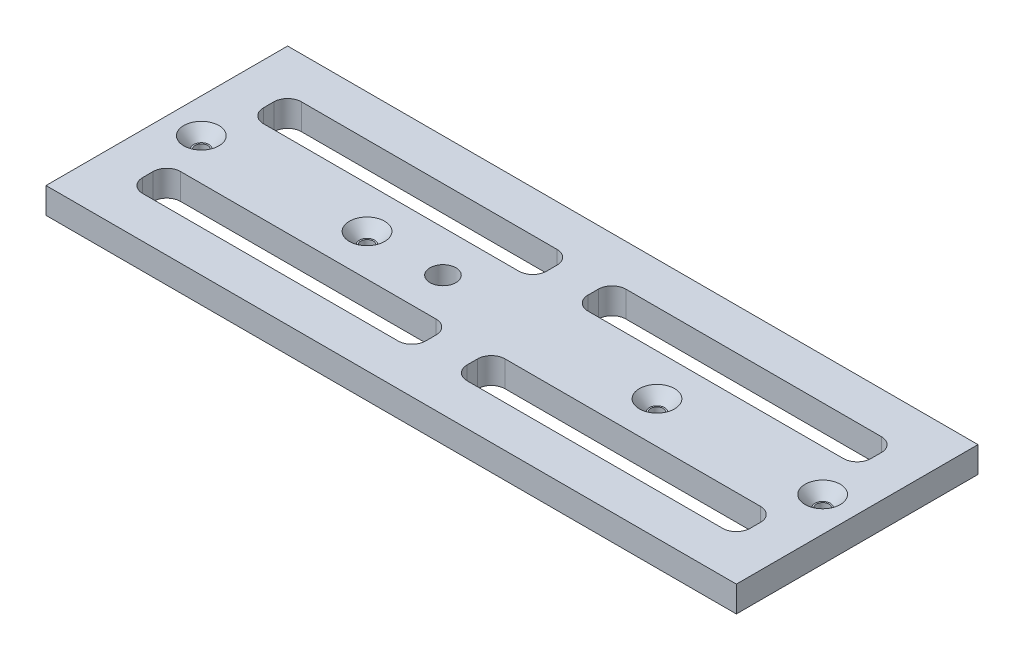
from build123d import *

# Parameters (mm, degrees)
SKETCH1_W                    = 127
SKETCH1_H                    = 44.45
BOSS_EXTRUDE1_DEPTH          = 4.7625
SKETCH3_R                    = 1.143
CUT_EXTRUDE2_DEPTH           = 68.445400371
SKETCH4_R                    = 3.2385
CUT_EXTRUDE3_DEPTH           = 2.1082
CUT_EXTRUDE3_DRAFT           = -41
CUT_EXTRUDE3_PROFILE_2_DEPTH = 2.1082
CUT_EXTRUDE3_PROFILE_2_DRAFT = -41
CUT_EXTRUDE3_PROFILE_3_DEPTH = 2.1082
CUT_EXTRUDE3_PROFILE_3_DRAFT = -41
CUT_EXTRUDE3_PROFILE_4_DEPTH = 2.1082
CUT_EXTRUDE3_PROFILE_4_DRAFT = -41
SKETCH5_R                    = 2.38125
CUT_EXTRUDE4_DEPTH           = 68.445400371
SKETCH6_W                    = 52.07
SKETCH6_H                    = 6.985
CUT_EXTRUDE5_DEPTH           = 68.445400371
FILLET1_R                    = 2.54


with BuildPart() as part:
    # Sketch1 → Boss-Extrude1 (new body)
    with BuildSketch(Plane(origin=(0, 0, 0), x_dir=(1, 0, 0), z_dir=(0, 1, 0))):
        Rectangle(SKETCH1_W, SKETCH1_H)
    extrude(amount=BOSS_EXTRUDE1_DEPTH)

    # Sketch3 → Cut-Extrude2 (cut, through all)
    with BuildSketch(Plane(origin=(0, 4.7625, 0), x_dir=(1, 0, 0), z_dir=(0, 1, 0))):
        with Locations(Location((-57.15, 0, 0), (0, 0, 270))):
            Circle(SKETCH3_R)
        with Locations(Location((-26.67, 0, 0), (0, 0, 270))):
            Circle(SKETCH3_R)
        with Locations(Location((26.67, 0, 0), (0, 0, 270))):
            Circle(SKETCH3_R)
        with Locations(Location((57.15, 0, 0), (0, 0, 270))):
            Circle(SKETCH3_R)
    extrude(amount=-CUT_EXTRUDE2_DEPTH, mode=Mode.SUBTRACT)


with BuildPart() as cut_extrude3_tool:
    # Sketch4 → Cut-Extrude3 (with draft: the straight prism first)
    with BuildSketch(Plane(origin=(0, 4.7625, 0), x_dir=(1, 0, 0), z_dir=(0, 1, 0))):
        with Locations((-57.15, 0)):
            Circle(SKETCH4_R)
    extrude(amount=-CUT_EXTRUDE3_DEPTH)
    # Cut-Extrude3: the draft: its side faces are tilted about the plane it starts from
    cut_extrude3_sides = [cut_extrude3_tool.faces().sort_by_distance(p)[0] for p in [
        (-60.3885, 3.7084, 0),
    ]]
    draft(cut_extrude3_sides, Plane(origin=(0, 4.7625, 0), x_dir=(1, 0, 0), z_dir=(0, 1, 0)), CUT_EXTRUDE3_DRAFT)


with BuildPart() as part_1:
    add(part.part)

    # Cut-Extrude3: cut by cut_extrude3_tool
    add(cut_extrude3_tool.part, mode=Mode.SUBTRACT)


with BuildPart() as cut_extrude3_profile_2_tool:
    # Sketch4 → Cut-Extrude3 profile 2 (with draft: the straight prism first)
    with BuildSketch(Plane(origin=(0, 4.7625, 0), x_dir=(1, 0, 0), z_dir=(0, 1, 0))):
        with Locations((-26.67, 0)):
            Circle(SKETCH4_R)
    extrude(amount=-CUT_EXTRUDE3_PROFILE_2_DEPTH)
    # Cut-Extrude3 profile 2: the draft: its side faces are tilted about the plane it starts from
    cut_extrude3_profile_2_sides = [cut_extrude3_profile_2_tool.faces().sort_by_distance(p)[0] for p in [
        (-29.9085, 3.7084, 0),
    ]]
    draft(cut_extrude3_profile_2_sides, Plane(origin=(0, 4.7625, 0), x_dir=(1, 0, 0), z_dir=(0, 1, 0)), CUT_EXTRUDE3_PROFILE_2_DRAFT)


with BuildPart() as part_2:
    add(part_1.part)

    # Cut-Extrude3 profile 2: cut by cut_extrude3_profile_2_tool
    add(cut_extrude3_profile_2_tool.part, mode=Mode.SUBTRACT)


with BuildPart() as cut_extrude3_profile_3_tool:
    # Sketch4 → Cut-Extrude3 profile 3 (with draft: the straight prism first)
    with BuildSketch(Plane(origin=(0, 4.7625, 0), x_dir=(1, 0, 0), z_dir=(0, 1, 0))):
        with Locations((26.67, 0)):
            Circle(SKETCH4_R)
    extrude(amount=-CUT_EXTRUDE3_PROFILE_3_DEPTH)
    # Cut-Extrude3 profile 3: the draft: its side faces are tilted about the plane it starts from
    cut_extrude3_profile_3_sides = [cut_extrude3_profile_3_tool.faces().sort_by_distance(p)[0] for p in [
        (23.4315, 3.7084, 0),
    ]]
    draft(cut_extrude3_profile_3_sides, Plane(origin=(0, 4.7625, 0), x_dir=(1, 0, 0), z_dir=(0, 1, 0)), CUT_EXTRUDE3_PROFILE_3_DRAFT)


with BuildPart() as part_3:
    add(part_2.part)

    # Cut-Extrude3 profile 3: cut by cut_extrude3_profile_3_tool
    add(cut_extrude3_profile_3_tool.part, mode=Mode.SUBTRACT)


with BuildPart() as cut_extrude3_profile_4_tool:
    # Sketch4 → Cut-Extrude3 profile 4 (with draft: the straight prism first)
    with BuildSketch(Plane(origin=(0, 4.7625, 0), x_dir=(1, 0, 0), z_dir=(0, 1, 0))):
        with Locations((57.15, 0)):
            Circle(SKETCH4_R)
    extrude(amount=-CUT_EXTRUDE3_PROFILE_4_DEPTH)
    # Cut-Extrude3 profile 4: the draft: its side faces are tilted about the plane it starts from
    cut_extrude3_profile_4_sides = [cut_extrude3_profile_4_tool.faces().sort_by_distance(p)[0] for p in [
        (53.9115, 3.7084, 0),
    ]]
    draft(cut_extrude3_profile_4_sides, Plane(origin=(0, 4.7625, 0), x_dir=(1, 0, 0), z_dir=(0, 1, 0)), CUT_EXTRUDE3_PROFILE_4_DRAFT)


with BuildPart() as part_4:
    add(part_3.part)

    # Cut-Extrude3 profile 4: cut by cut_extrude3_profile_4_tool
    add(cut_extrude3_profile_4_tool.part, mode=Mode.SUBTRACT)

    # Sketch5 → Cut-Extrude4 (cut, through all)
    with BuildSketch(Plane(origin=(0, 4.7625, 0), x_dir=(1, 0, 0), z_dir=(0, 1, 0))):
        with Locations(Location((-12.7, 0, 0), (0, 0, 270))):
            Circle(SKETCH5_R)
    extrude(amount=-CUT_EXTRUDE4_DEPTH, mode=Mode.SUBTRACT)

    # Sketch6 → Cut-Extrude5 (cut, through all)
    with BuildSketch(Plane(origin=(0, 4.7625, 0), x_dir=(1, 0, 0), z_dir=(0, 1, 0))):
        with Locations((-29.845, -11.1125)):
            Rectangle(SKETCH6_W, SKETCH6_H)
        with Locations((-29.845, 11.1125)):
            Rectangle(SKETCH6_W, SKETCH6_H)
        with Locations((29.845, -11.1125)):
            Rectangle(SKETCH6_W, SKETCH6_H)
        with Locations((29.845, 11.1125)):
            Rectangle(SKETCH6_W, SKETCH6_H)
    extrude(amount=-CUT_EXTRUDE5_DEPTH, mode=Mode.SUBTRACT)

    # Fillet1
    fillet1_edges = [part_4.edges().sort_by_distance(p)[0] for p in [
        (3.81, 2.38125, -14.605),
        (55.88, 2.38125, -14.605),
        (55.88, 2.38125, -7.62),
        (3.81, 2.38125, -7.62),
        (-55.88, 2.38125, -7.62),
        (-55.88, 2.38125, -14.605),
        (-3.81, 2.38125, -14.605),
        (-3.81, 2.38125, -7.62),
        (-3.81, 2.38125, 14.605),
        (-55.88, 2.38125, 14.605),
        (-55.88, 2.38125, 7.62),
        (-3.81, 2.38125, 7.62),
        (55.88, 2.38125, 7.62),
        (55.88, 2.38125, 14.605),
        (3.81, 2.38125, 14.605),
        (3.81, 2.38125, 7.62),
    ]]
    fillet(fillet1_edges, radius=FILLET1_R)


solid = part_4.part
